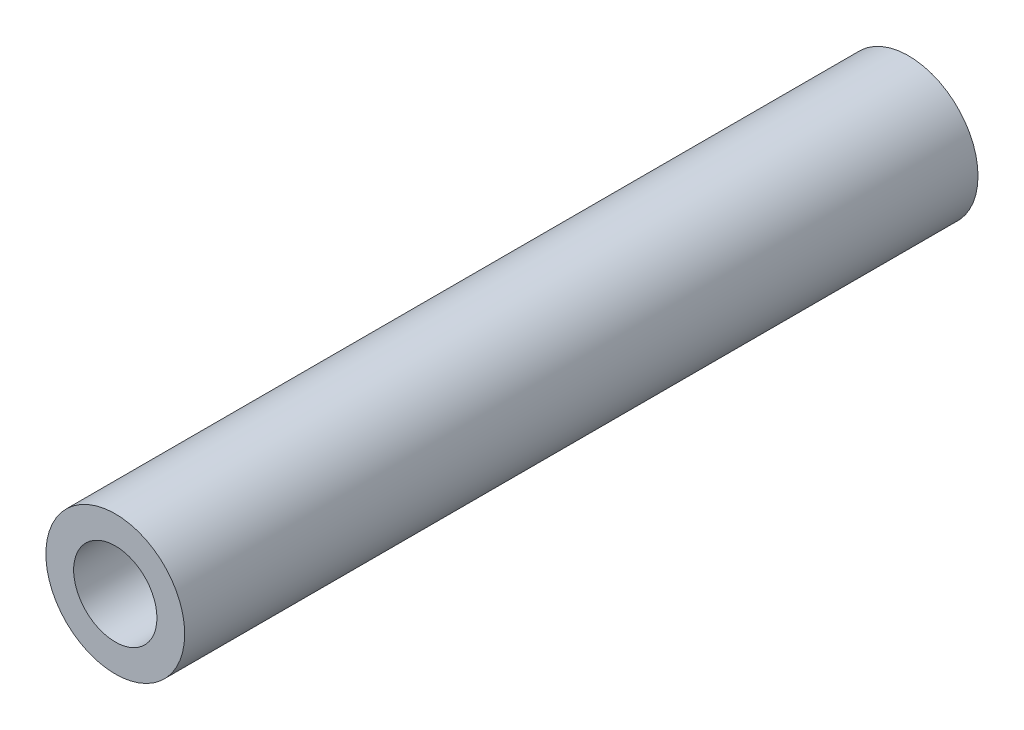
from build123d import *

# Parameters (mm, degrees)
SKETCH1_R           = 3.5
SKETCH1_R_2         = 2.1
BOSS_EXTRUDE1_DEPTH = 40


with BuildPart() as part:
    # Sketch1 → Boss-Extrude1 (new body)
    with BuildSketch(Plane.XY):
        with Locations((-93.239490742, 27.289806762)):
            Circle(SKETCH1_R)
        with Locations((-93.239490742, 27.289806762)):
            Circle(SKETCH1_R_2, mode=Mode.SUBTRACT)
    extrude(amount=BOSS_EXTRUDE1_DEPTH)


solid = part.part
